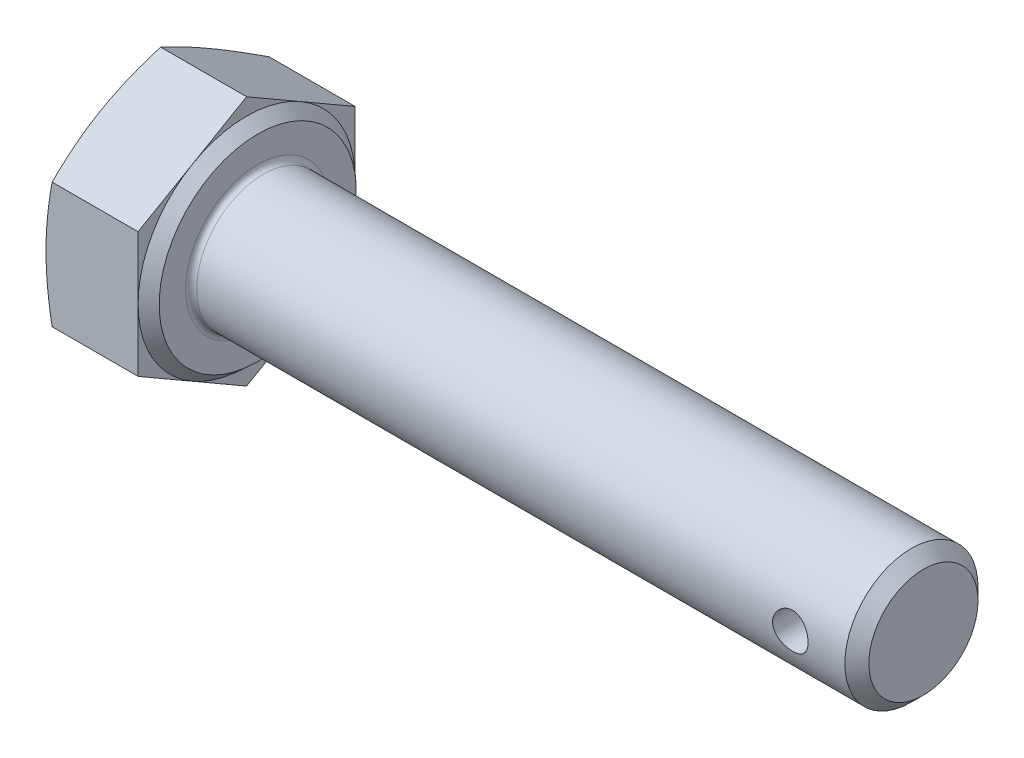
from build123d import *

# Parameters (mm, degrees)
BASEHEAD_DEPTH  = 4.15
SKETCH3_R       = 3
BASEBODY_DEPTH  = 30
CHAMFER1_SIZE   = 0.5415
HEADFILLET_R    = 0.25
HOLE_DEPTH      = 36.445978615
HOLE_DEPTH_BACK = 36.445978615
SKETCH5_R       = 0.8


with BuildPart() as part:
    # Sketch-BaseHead → BaseHead (new body)
    with BuildSketch(Plane(origin=(0, 0, 0), x_dir=(0, 0, -1), z_dir=(1, 0, 0))):
        Polygon((0, -5.646485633), (4.89, -2.823242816), (4.89, 2.823242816), (0, 5.646485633), (-4.89, 2.823242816), (-4.89, -2.823242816), align=None)
    extrude(amount=BASEHEAD_DEPTH)

    # Sketch4 → HeadChamfer (revolve, cut)
    with BuildSketch(Plane(origin=(-0.264637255, -5.916896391, 0), x_dir=(0, 1, 0), z_dir=(0, 0, 1))):
        Polygon((11.563382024, -0.264637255), (10.806896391, -0.264637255), (11.563382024, -0.539975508), align=None)
    revolve(axis=Axis((-4.001564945, 0, 0), (1, 0, 0)), mode=Mode.SUBTRACT)

    # Sketch1 → Revolve1 (revolve)
    with BuildSketch(Plane(origin=(0, 0, 0), x_dir=(1, 0, 0), z_dir=(0, 1, 0)), mode=Mode.PRIVATE) as revolve1_sk:
        Polygon((4.15, 0), (4.65, 0), (4.65, 4.44), (4.15, 4.89), align=None)
    revolve(revolve1_sk.sketch.rotate(Axis((-4.001564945, 0, 0), (1, 0, 0)), 270), axis=Axis((-4.001564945, 0, 0), (1, 0, 0)))

    # Sketch3 → BaseBody (add)
    with BuildSketch(Plane(origin=(4.65, 0, 0), x_dir=(0, 0, -1), z_dir=(1, 0, 0))):
        with Locations(Location((0, 0, 0), (0, 0, 270))):
            Circle(SKETCH3_R)
    extrude(amount=BASEBODY_DEPTH)

    # Chamfer1
    chamfer1_edges = [part.edges().sort_by_distance(p)[0] for p in [
        (34.65, 3, 0),
    ]]
    chamfer(chamfer1_edges, length=CHAMFER1_SIZE)

    # HeadFillet
    headfillet_edges = [part.edges().sort_by_distance(p)[0] for p in [
        (4.65, 3, 0),
    ]]
    fillet(headfillet_edges, radius=HEADFILLET_R)

    # Sketch5 → Hole (cut, two sides: drawn at the far end of the back side and taken through both)
    with BuildSketch(Plane.XY.offset(-HOLE_DEPTH_BACK)):
        with Locations((31.65, 0)):
            Circle(SKETCH5_R)
    extrude(amount=HOLE_DEPTH + HOLE_DEPTH_BACK, mode=Mode.SUBTRACT)


solid = part.part
